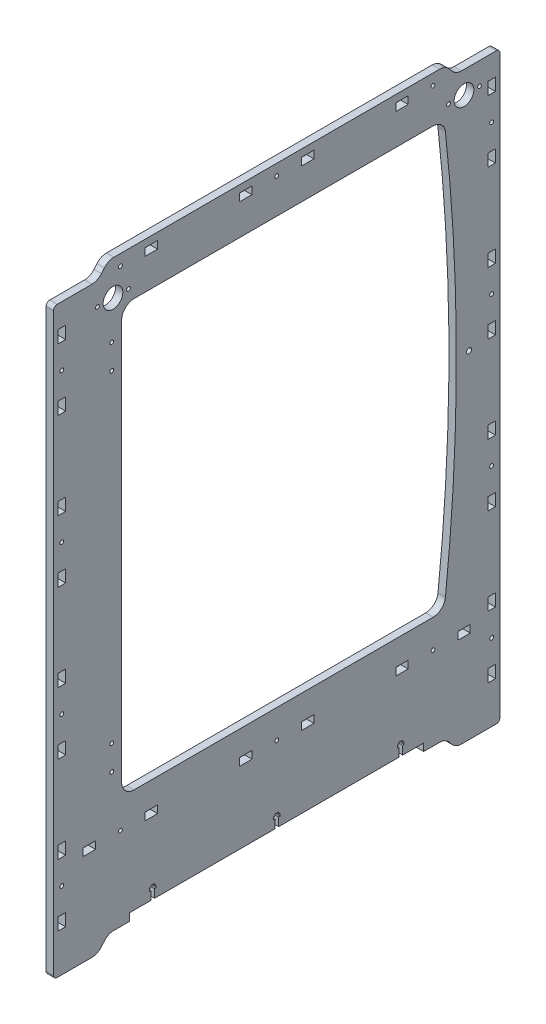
from build123d import *

# Parameters (mm, degrees)
SKETCH_1_R          = 1.55
SKETCH_1_R_2        = 7.95
SKETCH_1_W          = 10
SKETCH_1_H          = 6.1
SKETCH_1_W_2        = 6.1
SKETCH_1_H_2        = 10
EXTRUDE_1_DEPTH     = 6
CUT_EXTRUDE_1_DEPTH = 513.675335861
SKETCH_3_W          = 237
SKETCH_3_H          = 6
CUT_EXTRUDE_2_DEPTH = 513.675335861
CUT_EXTRUDE_3_DEPTH = 513.675335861
SKETCH_5_R          = 1.55
CUT_EXTRUDE_4_DEPTH = 513.675335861
SKETCH_6_R          = 2.05
CUT_EXTRUDE_5_DEPTH = 513.675335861


with BuildPart() as part:
    # Sketch 1 → Extrude 1 (new body)
    with BuildSketch(Plane(origin=(0, 0, 0), x_dir=(0, -1, 0), z_dir=(-1, 0, 0))):
        with BuildLine():
            Line((-473.572123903, -141.339555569), (-476.427876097, -138.943294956))
            ThreePointArc((-476.427876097, -138.943294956), (-479.06307787, -135.509033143), (-480, -131.282850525))
            Line((-480, -131.282850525), (-480, 131.282850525))
            ThreePointArc((-480, 131.282850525), (-479.06307787, 135.509033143), (-476.427876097, 138.943294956))
            Line((-476.427876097, 138.943294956), (-473.572123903, 141.339555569))
            ThreePointArc((-473.572123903, 141.339555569), (-470.93692213, 144.773817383), (-470, 149))
            Line((-470, 149), (-470, 177))
            ThreePointArc((-470, 177), (-469.121320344, 179.121320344), (-467, 180))
            Line((-467, 180), (-3, 180))
            ThreePointArc((-3, 180), (-0.878679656, 179.121320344), (0, 177))
            Line((0, 177), (0, 149))
            ThreePointArc((0, 149), (-0.93692213, 144.773817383), (-3.572123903, 141.339555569))
            Line((-3.572123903, 141.339555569), (-6.427876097, 138.943294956))
            ThreePointArc((-6.427876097, 138.943294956), (-9.06307787, 135.509033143), (-10, 131.282850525))
            Line((-10, 131.282850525), (-10, -131.282850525))
            ThreePointArc((-10, -131.282850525), (-9.06307787, -135.509033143), (-6.427876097, -138.943294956))
            Line((-6.427876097, -138.943294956), (-3.572123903, -141.339555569))
            ThreePointArc((-3.572123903, -141.339555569), (-0.93692213, -144.773817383), (0, -149))
            Line((0, -149), (0, -177))
            ThreePointArc((0, -177), (-0.878679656, -179.121320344), (-3, -180))
            Line((-3, -180), (-467, -180))
            ThreePointArc((-467, -180), (-469.121320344, -179.121320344), (-470, -177))
            Line((-470, -177), (-470, -149))
            ThreePointArc((-470, -149), (-470.93692213, -144.773817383), (-473.572123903, -141.339555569))
        make_face()
        with Locations(Location((-302, 173.25, 0), (0, 0, 90))):
            Circle(SKETCH_1_R, mode=Mode.SUBTRACT)
        with Locations(Location((-182, 173.25, 0), (0, 0, 90))):
            Circle(SKETCH_1_R, mode=Mode.SUBTRACT)
        with Locations(Location((-452, -163.5, 0), (0, 0, 90))):
            Circle(SKETCH_1_R, mode=Mode.SUBTRACT)
        with Locations(Location((-452, -138.5, 0), (0, 0, 90))):
            Circle(SKETCH_1_R, mode=Mode.SUBTRACT)
        with Locations(Location((-452, -151, 0), (0, 0, 90))):
            Circle(SKETCH_1_R_2, mode=Mode.SUBTRACT)
        with Locations(Location((-422, 173.25, 0), (0, 0, 90))):
            Circle(SKETCH_1_R, mode=Mode.SUBTRACT)
        with Locations(Location((-77, 0, 0), (0, 0, 90))):
            Circle(SKETCH_1_R, mode=Mode.SUBTRACT)
        with Locations(Location((-77, 126, 0), (0, 0, 90))):
            Circle(SKETCH_1_R, mode=Mode.SUBTRACT)
        with Locations(Location((-471.1, 126, 0), (0, 0, 90))):
            Circle(SKETCH_1_R, mode=Mode.SUBTRACT)
        with Locations(Location((-471.1, 0, 0), (0, 0, 90))):
            Circle(SKETCH_1_R, mode=Mode.SUBTRACT)
        with Locations(Location((-471.1, -126, 0), (0, 0, 90))):
            Circle(SKETCH_1_R, mode=Mode.SUBTRACT)
        with Locations(Location((-77, -126, 0), (0, 0, 90))):
            Circle(SKETCH_1_R, mode=Mode.SUBTRACT)
        with Locations(Location((-422, -173.25, 0), (0, 0, 90))):
            Circle(SKETCH_1_R, mode=Mode.SUBTRACT)
        with Locations(Location((-182, -173.25, 0), (0, 0, 90))):
            Circle(SKETCH_1_R, mode=Mode.SUBTRACT)
        with Locations(Location((-452, 132, 0), (0, 0, 90))):
            Circle(SKETCH_1_R_2, mode=Mode.SUBTRACT)
        with Locations(Location((-452, 119.5, 0), (0, 0, 90))):
            Circle(SKETCH_1_R, mode=Mode.SUBTRACT)
        with Locations(Location((-452, 144.5, 0), (0, 0, 90))):
            Circle(SKETCH_1_R, mode=Mode.SUBTRACT)
        with Locations(Location((-302, -173.25, 0), (0, 0, 90))):
            Circle(SKETCH_1_R, mode=Mode.SUBTRACT)
        with Locations(Location((-62, 173.25, 0), (0, 0, 90))):
            Circle(SKETCH_1_R, mode=Mode.SUBTRACT)
        with Locations(Location((-62, -173.25, 0), (0, 0, 90))):
            Circle(SKETCH_1_R, mode=Mode.SUBTRACT)
        with Locations((-397, 173.25)):
            Rectangle(SKETCH_1_W, SKETCH_1_H, mode=Mode.SUBTRACT)
        with Locations((-327, 173.25)):
            Rectangle(SKETCH_1_W, SKETCH_1_H, mode=Mode.SUBTRACT)
        with Locations((-277, 173.25)):
            Rectangle(SKETCH_1_W, SKETCH_1_H, mode=Mode.SUBTRACT)
        with Locations((-207, 173.25)):
            Rectangle(SKETCH_1_W, SKETCH_1_H, mode=Mode.SUBTRACT)
        with Locations((-157, 173.25)):
            Rectangle(SKETCH_1_W, SKETCH_1_H, mode=Mode.SUBTRACT)
        with Locations((-471.1, -25)):
            Rectangle(SKETCH_1_W_2, SKETCH_1_H_2, mode=Mode.SUBTRACT)
        with Locations((-447, 173.25)):
            Rectangle(SKETCH_1_W, SKETCH_1_H, mode=Mode.SUBTRACT)
        with Locations((-471.1, -101)):
            Rectangle(SKETCH_1_W_2, SKETCH_1_H_2, mode=Mode.SUBTRACT)
        with Locations((-77, -151)):
            Rectangle(SKETCH_1_W_2, SKETCH_1_H_2, mode=Mode.SUBTRACT)
        with Locations((-77, -101)):
            Rectangle(SKETCH_1_W_2, SKETCH_1_H_2, mode=Mode.SUBTRACT)
        with Locations((-77, -25)):
            Rectangle(SKETCH_1_W_2, SKETCH_1_H_2, mode=Mode.SUBTRACT)
        with Locations((-447, -173.25)):
            Rectangle(SKETCH_1_W, SKETCH_1_H, mode=Mode.SUBTRACT)
        with Locations((-157, -173.25)):
            Rectangle(SKETCH_1_W, SKETCH_1_H, mode=Mode.SUBTRACT)
        with Locations((-207, -173.25)):
            Rectangle(SKETCH_1_W, SKETCH_1_H, mode=Mode.SUBTRACT)
        with Locations((-277, -173.25)):
            Rectangle(SKETCH_1_W, SKETCH_1_H, mode=Mode.SUBTRACT)
        with Locations((-77, 25)):
            Rectangle(SKETCH_1_W_2, SKETCH_1_H_2, mode=Mode.SUBTRACT)
        with Locations((-77, 101)):
            Rectangle(SKETCH_1_W_2, SKETCH_1_H_2, mode=Mode.SUBTRACT)
        with Locations((-77, 151)):
            Rectangle(SKETCH_1_W_2, SKETCH_1_H_2, mode=Mode.SUBTRACT)
        with Locations((-471.1, 101)):
            Rectangle(SKETCH_1_W_2, SKETCH_1_H_2, mode=Mode.SUBTRACT)
        with Locations((-327, -173.25)):
            Rectangle(SKETCH_1_W, SKETCH_1_H, mode=Mode.SUBTRACT)
        with Locations((-471.1, 25)):
            Rectangle(SKETCH_1_W_2, SKETCH_1_H_2, mode=Mode.SUBTRACT)
        with Locations((-397, -173.25)):
            Rectangle(SKETCH_1_W, SKETCH_1_H, mode=Mode.SUBTRACT)
        with Locations((-87, 173.25)):
            Rectangle(SKETCH_1_W, SKETCH_1_H, mode=Mode.SUBTRACT)
        with Locations((-37, 173.25)):
            Rectangle(SKETCH_1_W, SKETCH_1_H, mode=Mode.SUBTRACT)
        with Locations((-37, -173.25)):
            Rectangle(SKETCH_1_W, SKETCH_1_H, mode=Mode.SUBTRACT)
        with Locations((-87, -173.25)):
            Rectangle(SKETCH_1_W, SKETCH_1_H, mode=Mode.SUBTRACT)
    extrude(amount=-EXTRUDE_1_DEPTH)

    # Sketch 2 → Cut-Extrude 1 (cut, through all)
    with BuildSketch(Plane.ZY):
        with BuildLine():
            Line((-126.058043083, 443), (115, 443))
            ThreePointArc((115, 443), (122.071067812, 440.071067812), (125, 433))
            Line((125, 433), (125, 110))
            ThreePointArc((125, 110), (122.071067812, 102.928932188), (115, 100))
            Line((115, 100), (-126.058043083, 100))
            ThreePointArc((-126.058043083, 100), (-132.734908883, 102.555575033), (-135.999128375, 108.916107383))
            ThreePointArc((-135.999128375, 108.916107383), (-144.836334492, 271.5), (-135.999128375, 434.083892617))
            ThreePointArc((-135.999128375, 434.083892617), (-132.734908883, 440.444424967), (-126.058043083, 443))
        make_face()
    extrude(amount=-CUT_EXTRUDE_1_DEPTH, mode=Mode.SUBTRACT)

    # Sketch 3 → Cut-Extrude 2 (cut, through all)
    with BuildSketch(Plane.ZY):
        with Locations((0, 13)):
            Rectangle(SKETCH_3_W, SKETCH_3_H)
    extrude(amount=-CUT_EXTRUDE_2_DEPTH, mode=Mode.SUBTRACT)

    # Sketch 4 → Cut-Extrude 3 (cut, through all)
    with BuildSketch(Plane.ZY):
        Polygon((-1.55, 16), (1.55, 16), (1.55, 22.8), (2.75, 22.8), (2.75, 25), (1.55, 25), (1.55, 26.5), (-1.55, 26.5), (-1.55, 25), (-2.75, 25), (-2.75, 22.8), (-1.55, 22.8), align=None)
        Polygon((101.55, 26.5), (98.45, 26.5), (98.45, 25), (97.25, 25), (97.25, 22.8), (98.45, 22.8), (98.45, 16), (101.55, 16), (101.55, 22.8), (102.75, 22.8), (102.75, 25), (101.55, 25), align=None)
        Polygon((-101.55, 22.8), (-102.75, 22.8), (-102.75, 25), (-101.55, 25), (-101.55, 26.5), (-98.45, 26.5), (-98.45, 25), (-97.25, 25), (-97.25, 22.8), (-98.45, 22.8), (-98.45, 16), (-101.55, 16), align=None)
    extrude(amount=-CUT_EXTRUDE_3_DEPTH, mode=Mode.SUBTRACT)

    # Sketch 5 → Cut-Extrude 4 (cut, through all)
    with BuildSketch(Plane.ZY):
        with Locations((133, 421.5)):
            Circle(SKETCH_5_R)
        with Locations((133, 401.5)):
            Circle(SKETCH_5_R)
        with Locations((133, 141.5)):
            Circle(SKETCH_5_R)
        with Locations((133, 121.5)):
            Circle(SKETCH_5_R)
    extrude(amount=-CUT_EXTRUDE_4_DEPTH, mode=Mode.SUBTRACT)

    # Sketch 6 → Cut-Extrude 5 (cut, through all)
    with BuildSketch(Plane.ZY):
        with Locations((-155, 271.5)):
            Circle(SKETCH_6_R)
    extrude(amount=-CUT_EXTRUDE_5_DEPTH, mode=Mode.SUBTRACT)


solid = part.part
